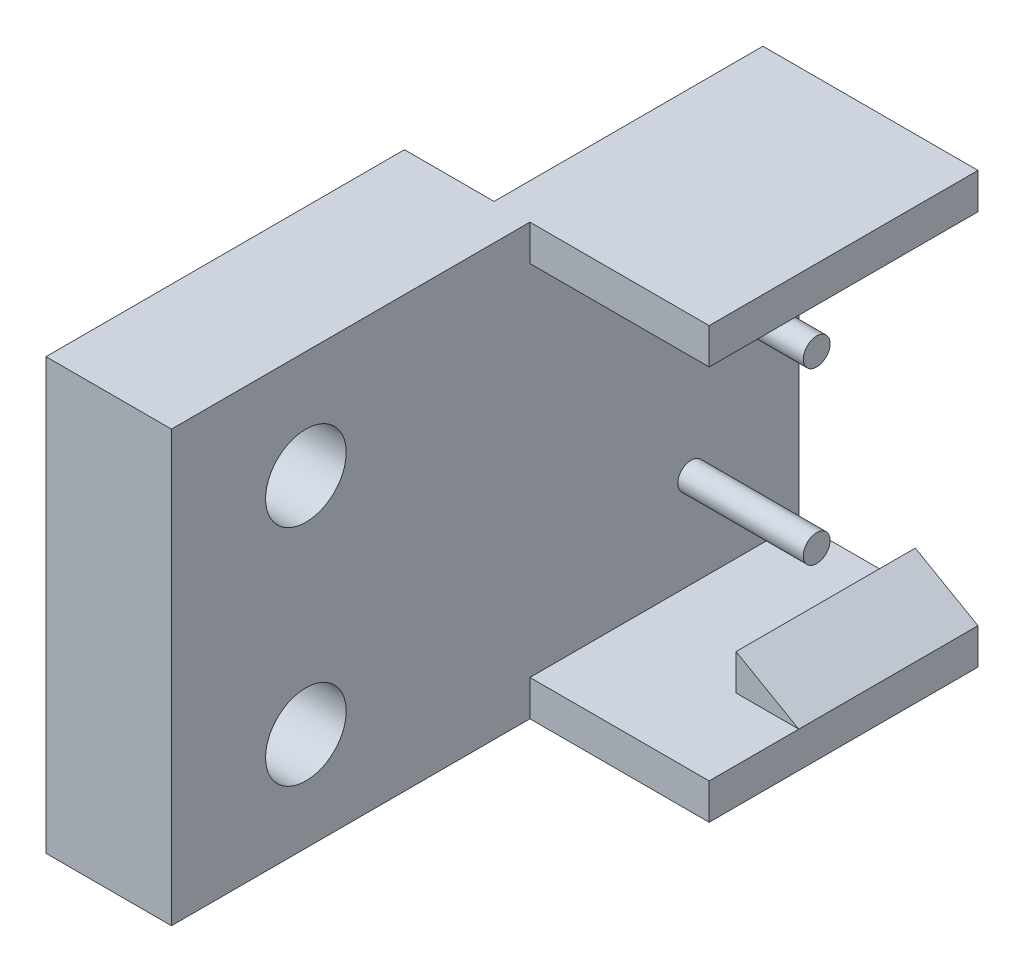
ISO-10303-21;
HEADER;
FILE_DESCRIPTION(('STEP AP214'),'2;1');
FILE_NAME('part.step','',(''),(''),'','','');
FILE_SCHEMA(('AUTOMOTIVE_DESIGN { 1 0 10303 214 1 1 1 1 }'));
ENDSEC;
DATA;
#1=APPLICATION_CONTEXT('core data for automotive mechanical design processes');
#2=APPLICATION_PROTOCOL_DEFINITION('international standard','automotive_design',2000,#1);
#3=PRODUCT_CONTEXT('',#1,'mechanical');
#4=PRODUCT('Part','Part','',(#3));
#5=PRODUCT_RELATED_PRODUCT_CATEGORY('part','',(#4));
#6=PRODUCT_DEFINITION_FORMATION('','',#4);
#7=PRODUCT_DEFINITION_CONTEXT('part definition',#1,'design');
#8=PRODUCT_DEFINITION('design','',#6,#7);
#9=PRODUCT_DEFINITION_SHAPE('','',#8);
#10=(LENGTH_UNIT() NAMED_UNIT(*) SI_UNIT(.MILLI.,.METRE.));
#11=(NAMED_UNIT(*) PLANE_ANGLE_UNIT() SI_UNIT($,.RADIAN.));
#12=(NAMED_UNIT(*) SI_UNIT($,.STERADIAN.) SOLID_ANGLE_UNIT());
#13=UNCERTAINTY_MEASURE_WITH_UNIT(LENGTH_MEASURE(1.E-05),#10,'distance_accuracy_value','');
#14=(GEOMETRIC_REPRESENTATION_CONTEXT(3) GLOBAL_UNCERTAINTY_ASSIGNED_CONTEXT((#13)) GLOBAL_UNIT_ASSIGNED_CONTEXT((#10,
#11,#12)) REPRESENTATION_CONTEXT('',''));
#15=CARTESIAN_POINT('',(0.,0.,0.));
#16=DIRECTION('',(0.,0.,1.));
#17=DIRECTION('',(1.,0.,0.));
#18=AXIS2_PLACEMENT_3D('',#15,#16,#17);
#19=CARTESIAN_POINT('',(2.,0.,0.));
#20=DIRECTION('',(0.,0.,-1.));
#21=DIRECTION('',(0.,1.,0.));
#22=AXIS2_PLACEMENT_3D('',#19,#20,#21);
#23=PLANE('',#22);
#24=DIRECTION('',(-1.,0.,0.));
#25=VECTOR('',#24,1.);
#26=CARTESIAN_POINT('',(2.,24.,0.));
#27=LINE('',#26,#25);
#28=CARTESIAN_POINT('',(12.,24.,0.));
#29=VERTEX_POINT('',#28);
#30=CARTESIAN_POINT('',(2.,24.,0.));
#31=VERTEX_POINT('',#30);
#32=EDGE_CURVE('E223',#29,#31,#27,.T.);
#33=ORIENTED_EDGE('',*,*,#32,.T.);
#34=DIRECTION('',(0.,-1.,0.));
#35=VECTOR('',#34,1.);
#36=CARTESIAN_POINT('',(2.,24.,0.));
#37=LINE('',#36,#35);
#38=CARTESIAN_POINT('',(2.,22.,0.));
#39=VERTEX_POINT('',#38);
#40=EDGE_CURVE('E175',#31,#39,#37,.T.);
#41=ORIENTED_EDGE('',*,*,#40,.T.);
#42=DIRECTION('',(-1.,0.,0.));
#43=VECTOR('',#42,1.);
#44=CARTESIAN_POINT('',(12.,22.,0.));
#45=LINE('',#44,#43);
#46=CARTESIAN_POINT('',(12.,22.,0.));
#47=VERTEX_POINT('',#46);
#48=EDGE_CURVE('E212',#47,#39,#45,.T.);
#49=ORIENTED_EDGE('',*,*,#48,.F.);
#50=DIRECTION('',(0.,-1.,0.));
#51=VECTOR('',#50,1.);
#52=CARTESIAN_POINT('',(12.,24.,0.));
#53=LINE('',#52,#51);
#54=EDGE_CURVE('E236',#29,#47,#53,.T.);
#55=ORIENTED_EDGE('',*,*,#54,.F.);
#56=EDGE_LOOP('',(#33,#41,#49,#55));
#57=FACE_BOUND('',#56,.T.);
#58=ADVANCED_FACE('F33',(#57),#23,.F.);
#59=CARTESIAN_POINT('',(2.,0.,0.));
#60=DIRECTION('',(-1.,0.,0.));
#61=DIRECTION('',(0.,0.,1.));
#62=AXIS2_PLACEMENT_3D('',#59,#60,#61);
#63=PLANE('',#62);
#64=CARTESIAN_POINT('',(2.,16.75,-9.));
#65=DIRECTION('',(-1.,0.,0.));
#66=DIRECTION('',(0.,0.,1.));
#67=AXIS2_PLACEMENT_3D('',#64,#65,#66);
#68=CIRCLE('',#67,0.75);
#69=CARTESIAN_POINT('',(2.,16.75,-8.25));
#70=VERTEX_POINT('',#69);
#71=EDGE_CURVE('E228',#70,#70,#68,.F.);
#72=ORIENTED_EDGE('',*,*,#71,.F.);
#73=EDGE_LOOP('',(#72));
#74=FACE_BOUND('',#73,.T.);
#75=DIRECTION('',(0.,0.,1.));
#76=VECTOR('',#75,1.);
#77=CARTESIAN_POINT('',(2.,2.,0.));
#78=LINE('',#77,#76);
#79=CARTESIAN_POINT('',(2.,2.,-15.));
#80=VERTEX_POINT('',#79);
#81=CARTESIAN_POINT('',(2.,2.,0.));
#82=VERTEX_POINT('',#81);
#83=EDGE_CURVE('E184',#80,#82,#78,.T.);
#84=ORIENTED_EDGE('',*,*,#83,.F.);
#85=DIRECTION('',(0.,1.,0.));
#86=VECTOR('',#85,1.);
#87=CARTESIAN_POINT('',(2.,0.,-15.));
#88=LINE('',#87,#86);
#89=CARTESIAN_POINT('',(2.,22.,-15.));
#90=VERTEX_POINT('',#89);
#91=EDGE_CURVE('E205',#80,#90,#88,.T.);
#92=ORIENTED_EDGE('',*,*,#91,.T.);
#93=DIRECTION('',(0.,0.,-1.));
#94=VECTOR('',#93,1.);
#95=CARTESIAN_POINT('',(2.,22.,0.));
#96=LINE('',#95,#94);
#97=EDGE_CURVE('E233',#39,#90,#96,.T.);
#98=ORIENTED_EDGE('',*,*,#97,.F.);
#99=ORIENTED_EDGE('',*,*,#40,.F.);
#100=DIRECTION('',(0.,0.,-1.));
#101=VECTOR('',#100,1.);
#102=CARTESIAN_POINT('',(2.,24.,0.));
#103=LINE('',#102,#101);
#104=CARTESIAN_POINT('',(2.,24.,20.));
#105=VERTEX_POINT('',#104);
#106=EDGE_CURVE('E169',#105,#31,#103,.T.);
#107=ORIENTED_EDGE('',*,*,#106,.F.);
#108=DIRECTION('',(0.,1.,0.));
#109=VECTOR('',#108,1.);
#110=CARTESIAN_POINT('',(2.,24.,20.));
#111=LINE('',#110,#109);
#112=CARTESIAN_POINT('',(2.,0.,20.));
#113=VERTEX_POINT('',#112);
#114=EDGE_CURVE('E158',#113,#105,#111,.T.);
#115=ORIENTED_EDGE('',*,*,#114,.F.);
#116=DIRECTION('',(0.,0.,1.));
#117=VECTOR('',#116,1.);
#118=CARTESIAN_POINT('',(2.,0.,0.));
#119=LINE('',#118,#117);
#120=CARTESIAN_POINT('',(2.,0.,0.));
#121=VERTEX_POINT('',#120);
#122=EDGE_CURVE('E50',#121,#113,#119,.T.);
#123=ORIENTED_EDGE('',*,*,#122,.F.);
#124=EDGE_CURVE('E11',#82,#121,#37,.T.);
#125=ORIENTED_EDGE('',*,*,#124,.F.);
#126=EDGE_LOOP('',(#84,#92,#98,#99,#107,#115,#123,#125));
#127=FACE_BOUND('',#126,.T.);
#128=CARTESIAN_POINT('',(2.,7.25,-9.));
#129=DIRECTION('',(-1.,0.,0.));
#130=DIRECTION('',(0.,0.,1.));
#131=AXIS2_PLACEMENT_3D('',#128,#129,#130);
#132=CIRCLE('',#131,0.75);
#133=CARTESIAN_POINT('',(2.,7.25,-8.25));
#134=VERTEX_POINT('',#133);
#135=EDGE_CURVE('E42',#134,#134,#132,.F.);
#136=ORIENTED_EDGE('',*,*,#135,.F.);
#137=EDGE_LOOP('',(#136));
#138=FACE_BOUND('',#137,.T.);
#139=CARTESIAN_POINT('',(2.,5.5,12.5));
#140=DIRECTION('',(-1.,0.,0.));
#141=DIRECTION('',(0.,0.,1.));
#142=AXIS2_PLACEMENT_3D('',#139,#140,#141);
#143=CIRCLE('',#142,2.25);
#144=CARTESIAN_POINT('',(2.,5.5,14.75));
#145=VERTEX_POINT('',#144);
#146=EDGE_CURVE('E342',#145,#145,#143,.T.);
#147=ORIENTED_EDGE('',*,*,#146,.T.);
#148=EDGE_LOOP('',(#147));
#149=FACE_BOUND('',#148,.T.);
#150=CARTESIAN_POINT('',(2.,18.,12.5));
#151=DIRECTION('',(-1.,0.,0.));
#152=DIRECTION('',(0.,0.,1.));
#153=AXIS2_PLACEMENT_3D('',#150,#151,#152);
#154=CIRCLE('',#153,2.25);
#155=CARTESIAN_POINT('',(2.,18.,14.75));
#156=VERTEX_POINT('',#155);
#157=EDGE_CURVE('E177',#156,#156,#154,.T.);
#158=ORIENTED_EDGE('',*,*,#157,.T.);
#159=EDGE_LOOP('',(#158));
#160=FACE_BOUND('',#159,.T.);
#161=ADVANCED_FACE('F166',(#74,#127,#138,#149,#160),#63,.F.);
#162=DIRECTION('',(-1.,0.,0.));
#163=VECTOR('',#162,1.);
#164=CARTESIAN_POINT('',(12.,2.,0.));
#165=LINE('',#164,#163);
#166=CARTESIAN_POINT('',(12.,2.,0.));
#167=VERTEX_POINT('',#166);
#168=EDGE_CURVE('E191',#167,#82,#165,.T.);
#169=ORIENTED_EDGE('',*,*,#168,.T.);
#170=ORIENTED_EDGE('',*,*,#124,.T.);
#171=DIRECTION('',(-1.,0.,0.));
#172=VECTOR('',#171,1.);
#173=CARTESIAN_POINT('',(2.,0.,0.));
#174=LINE('',#173,#172);
#175=CARTESIAN_POINT('',(12.,0.,0.));
#176=VERTEX_POINT('',#175);
#177=EDGE_CURVE('E174',#176,#121,#174,.T.);
#178=ORIENTED_EDGE('',*,*,#177,.F.);
#179=DIRECTION('',(0.,-1.,0.));
#180=VECTOR('',#179,1.);
#181=CARTESIAN_POINT('',(12.,0.,0.));
#182=LINE('',#181,#180);
#183=EDGE_CURVE('E187',#167,#176,#182,.T.);
#184=ORIENTED_EDGE('',*,*,#183,.F.);
#185=EDGE_LOOP('',(#169,#170,#178,#184));
#186=FACE_BOUND('',#185,.T.);
#187=ADVANCED_FACE('F35',(#186),#23,.F.);
#188=CARTESIAN_POINT('',(2.,0.,0.));
#189=DIRECTION('',(0.,1.,0.));
#190=DIRECTION('',(0.,0.,1.));
#191=AXIS2_PLACEMENT_3D('',#188,#189,#190);
#192=PLANE('',#191);
#193=DIRECTION('',(0.,0.,-1.));
#194=VECTOR('',#193,1.);
#195=CARTESIAN_POINT('',(0.,0.,0.));
#196=LINE('',#195,#194);
#197=CARTESIAN_POINT('',(0.,0.,0.));
#198=VERTEX_POINT('',#197);
#199=CARTESIAN_POINT('',(0.,0.,-15.));
#200=VERTEX_POINT('',#199);
#201=EDGE_CURVE('E211',#198,#200,#196,.T.);
#202=ORIENTED_EDGE('',*,*,#201,.T.);
#203=DIRECTION('',(-1.,0.,0.));
#204=VECTOR('',#203,1.);
#205=CARTESIAN_POINT('',(2.,0.,-15.));
#206=LINE('',#205,#204);
#207=CARTESIAN_POINT('',(12.,0.,-15.));
#208=VERTEX_POINT('',#207);
#209=EDGE_CURVE('E229',#208,#200,#206,.T.);
#210=ORIENTED_EDGE('',*,*,#209,.F.);
#211=DIRECTION('',(0.,0.,-1.));
#212=VECTOR('',#211,1.);
#213=CARTESIAN_POINT('',(12.,0.,0.));
#214=LINE('',#213,#212);
#215=EDGE_CURVE('E260',#176,#208,#214,.T.);
#216=ORIENTED_EDGE('',*,*,#215,.F.);
#217=ORIENTED_EDGE('',*,*,#177,.T.);
#218=ORIENTED_EDGE('',*,*,#122,.T.);
#219=DIRECTION('',(1.,0.,0.));
#220=VECTOR('',#219,1.);
#221=CARTESIAN_POINT('',(-5.,0.,20.));
#222=LINE('',#221,#220);
#223=CARTESIAN_POINT('',(-5.,0.,20.));
#224=VERTEX_POINT('',#223);
#225=EDGE_CURVE('E155',#224,#113,#222,.T.);
#226=ORIENTED_EDGE('',*,*,#225,.F.);
#227=DIRECTION('',(0.,0.,1.));
#228=VECTOR('',#227,1.);
#229=CARTESIAN_POINT('',(-5.,0.,0.));
#230=LINE('',#229,#228);
#231=CARTESIAN_POINT('',(-5.,0.,0.));
#232=VERTEX_POINT('',#231);
#233=EDGE_CURVE('E328',#232,#224,#230,.T.);
#234=ORIENTED_EDGE('',*,*,#233,.F.);
#235=DIRECTION('',(1.,0.,0.));
#236=VECTOR('',#235,1.);
#237=CARTESIAN_POINT('',(-5.,0.,0.));
#238=LINE('',#237,#236);
#239=EDGE_CURVE('E162',#232,#198,#238,.T.);
#240=ORIENTED_EDGE('',*,*,#239,.T.);
#241=EDGE_LOOP('',(#202,#210,#216,#217,#218,#226,#234,#240));
#242=FACE_BOUND('',#241,.T.);
#243=ADVANCED_FACE('F172',(#242),#192,.F.);
#244=CARTESIAN_POINT('',(2.,0.,-15.));
#245=DIRECTION('',(0.,0.,1.));
#246=DIRECTION('',(0.,-1.,0.));
#247=AXIS2_PLACEMENT_3D('',#244,#245,#246);
#248=PLANE('',#247);
#249=DIRECTION('',(0.,1.,0.));
#250=VECTOR('',#249,1.);
#251=CARTESIAN_POINT('',(0.,0.,-15.));
#252=LINE('',#251,#250);
#253=CARTESIAN_POINT('',(0.,24.,-15.));
#254=VERTEX_POINT('',#253);
#255=EDGE_CURVE('E206',#200,#254,#252,.T.);
#256=ORIENTED_EDGE('',*,*,#255,.T.);
#257=DIRECTION('',(-1.,0.,0.));
#258=VECTOR('',#257,1.);
#259=CARTESIAN_POINT('',(2.,24.,-15.));
#260=LINE('',#259,#258);
#261=CARTESIAN_POINT('',(12.,24.,-15.));
#262=VERTEX_POINT('',#261);
#263=EDGE_CURVE('E221',#262,#254,#260,.T.);
#264=ORIENTED_EDGE('',*,*,#263,.F.);
#265=DIRECTION('',(0.,1.,0.));
#266=VECTOR('',#265,1.);
#267=CARTESIAN_POINT('',(12.,24.,-15.));
#268=LINE('',#267,#266);
#269=CARTESIAN_POINT('',(12.,22.,-15.));
#270=VERTEX_POINT('',#269);
#271=EDGE_CURVE('E245',#270,#262,#268,.T.);
#272=ORIENTED_EDGE('',*,*,#271,.F.);
#273=DIRECTION('',(-0.868243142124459,-0.496138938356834,0.));
#274=VECTOR('',#273,1.);
#275=CARTESIAN_POINT('',(12.,22.,-15.));
#276=LINE('',#275,#274);
#277=CARTESIAN_POINT('',(8.5,20.,-15.));
#278=VERTEX_POINT('',#277);
#279=EDGE_CURVE('E276',#270,#278,#276,.T.);
#280=ORIENTED_EDGE('',*,*,#279,.T.);
#281=DIRECTION('',(0.,1.,0.));
#282=VECTOR('',#281,1.);
#283=CARTESIAN_POINT('',(8.5,20.,-15.));
#284=LINE('',#283,#282);
#285=CARTESIAN_POINT('',(8.5,22.,-15.));
#286=VERTEX_POINT('',#285);
#287=EDGE_CURVE('E272',#278,#286,#284,.T.);
#288=ORIENTED_EDGE('',*,*,#287,.T.);
#289=DIRECTION('',(-1.,0.,0.));
#290=VECTOR('',#289,1.);
#291=CARTESIAN_POINT('',(12.,22.,-15.));
#292=LINE('',#291,#290);
#293=EDGE_CURVE('E244',#286,#90,#292,.T.);
#294=ORIENTED_EDGE('',*,*,#293,.T.);
#295=ORIENTED_EDGE('',*,*,#91,.F.);
#296=DIRECTION('',(-1.,0.,0.));
#297=VECTOR('',#296,1.);
#298=CARTESIAN_POINT('',(12.,2.,-15.));
#299=LINE('',#298,#297);
#300=CARTESIAN_POINT('',(8.5,2.,-15.));
#301=VERTEX_POINT('',#300);
#302=EDGE_CURVE('E194',#301,#80,#299,.T.);
#303=ORIENTED_EDGE('',*,*,#302,.F.);
#304=DIRECTION('',(0.,1.,0.));
#305=VECTOR('',#304,1.);
#306=CARTESIAN_POINT('',(8.5,4.,-15.));
#307=LINE('',#306,#305);
#308=CARTESIAN_POINT('',(8.5,4.,-15.));
#309=VERTEX_POINT('',#308);
#310=EDGE_CURVE('E295',#301,#309,#307,.T.);
#311=ORIENTED_EDGE('',*,*,#310,.T.);
#312=DIRECTION('',(0.868243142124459,-0.496138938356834,0.));
#313=VECTOR('',#312,1.);
#314=CARTESIAN_POINT('',(12.,2.,-15.));
#315=LINE('',#314,#313);
#316=CARTESIAN_POINT('',(12.,2.,-15.));
#317=VERTEX_POINT('',#316);
#318=EDGE_CURVE('E291',#309,#317,#315,.T.);
#319=ORIENTED_EDGE('',*,*,#318,.T.);
#320=DIRECTION('',(0.,1.,0.));
#321=VECTOR('',#320,1.);
#322=CARTESIAN_POINT('',(12.,0.,-15.));
#323=LINE('',#322,#321);
#324=EDGE_CURVE('E257',#208,#317,#323,.T.);
#325=ORIENTED_EDGE('',*,*,#324,.F.);
#326=ORIENTED_EDGE('',*,*,#209,.T.);
#327=EDGE_LOOP('',(#256,#264,#272,#280,#288,#294,#295,#303,#311,#319,#325,#326));
#328=FACE_BOUND('',#327,.T.);
#329=ADVANCED_FACE('F370',(#328),#248,.F.);
#330=CARTESIAN_POINT('',(2.,24.,0.));
#331=DIRECTION('',(0.,-1.,0.));
#332=DIRECTION('',(0.,0.,-1.));
#333=AXIS2_PLACEMENT_3D('',#330,#331,#332);
#334=PLANE('',#333);
#335=DIRECTION('',(0.,0.,1.));
#336=VECTOR('',#335,1.);
#337=CARTESIAN_POINT('',(0.,24.,0.));
#338=LINE('',#337,#336);
#339=CARTESIAN_POINT('',(0.,24.,0.));
#340=VERTEX_POINT('',#339);
#341=EDGE_CURVE('E202',#254,#340,#338,.T.);
#342=ORIENTED_EDGE('',*,*,#341,.T.);
#343=DIRECTION('',(1.,0.,0.));
#344=VECTOR('',#343,1.);
#345=CARTESIAN_POINT('',(-5.,24.,0.));
#346=LINE('',#345,#344);
#347=CARTESIAN_POINT('',(-5.,24.,0.));
#348=VERTEX_POINT('',#347);
#349=EDGE_CURVE('E315',#348,#340,#346,.T.);
#350=ORIENTED_EDGE('',*,*,#349,.F.);
#351=DIRECTION('',(0.,0.,-1.));
#352=VECTOR('',#351,1.);
#353=CARTESIAN_POINT('',(-5.,24.,0.));
#354=LINE('',#353,#352);
#355=CARTESIAN_POINT('',(-5.,24.,20.));
#356=VERTEX_POINT('',#355);
#357=EDGE_CURVE('E317',#356,#348,#354,.T.);
#358=ORIENTED_EDGE('',*,*,#357,.F.);
#359=DIRECTION('',(1.,0.,0.));
#360=VECTOR('',#359,1.);
#361=CARTESIAN_POINT('',(-5.,24.,20.));
#362=LINE('',#361,#360);
#363=EDGE_CURVE('E163',#356,#105,#362,.T.);
#364=ORIENTED_EDGE('',*,*,#363,.T.);
#365=ORIENTED_EDGE('',*,*,#106,.T.);
#366=ORIENTED_EDGE('',*,*,#32,.F.);
#367=DIRECTION('',(0.,0.,1.));
#368=VECTOR('',#367,1.);
#369=CARTESIAN_POINT('',(12.,24.,0.));
#370=LINE('',#369,#368);
#371=EDGE_CURVE('E241',#262,#29,#370,.T.);
#372=ORIENTED_EDGE('',*,*,#371,.F.);
#373=ORIENTED_EDGE('',*,*,#263,.T.);
#374=EDGE_LOOP('',(#342,#350,#358,#364,#365,#366,#372,#373));
#375=FACE_BOUND('',#374,.T.);
#376=ADVANCED_FACE('F323',(#375),#334,.F.);
#377=CARTESIAN_POINT('',(0.,0.,0.));
#378=DIRECTION('',(-1.,0.,0.));
#379=DIRECTION('',(0.,0.,1.));
#380=AXIS2_PLACEMENT_3D('',#377,#378,#379);
#381=PLANE('',#380);
#382=DIRECTION('',(0.,-1.,0.));
#383=VECTOR('',#382,1.);
#384=CARTESIAN_POINT('',(0.,0.,0.));
#385=LINE('',#384,#383);
#386=EDGE_CURVE('E209',#340,#198,#385,.T.);
#387=ORIENTED_EDGE('',*,*,#386,.F.);
#388=ORIENTED_EDGE('',*,*,#341,.F.);
#389=ORIENTED_EDGE('',*,*,#255,.F.);
#390=ORIENTED_EDGE('',*,*,#201,.F.);
#391=EDGE_LOOP('',(#387,#388,#389,#390));
#392=FACE_BOUND('',#391,.T.);
#393=ADVANCED_FACE('F454',(#392),#381,.T.);
#394=CARTESIAN_POINT('',(12.,22.,0.));
#395=DIRECTION('',(0.,1.,0.));
#396=DIRECTION('',(0.,0.,1.));
#397=AXIS2_PLACEMENT_3D('',#394,#395,#396);
#398=PLANE('',#397);
#399=ORIENTED_EDGE('',*,*,#293,.F.);
#400=DIRECTION('',(0.,0.,-1.));
#401=VECTOR('',#400,1.);
#402=CARTESIAN_POINT('',(8.5,22.,-5.));
#403=LINE('',#402,#401);
#404=CARTESIAN_POINT('',(8.5,22.,-5.));
#405=VERTEX_POINT('',#404);
#406=EDGE_CURVE('E188',#405,#286,#403,.T.);
#407=ORIENTED_EDGE('',*,*,#406,.F.);
#408=DIRECTION('',(1.,0.,0.));
#409=VECTOR('',#408,1.);
#410=CARTESIAN_POINT('',(12.,22.,-5.));
#411=LINE('',#410,#409);
#412=CARTESIAN_POINT('',(12.,22.,-5.));
#413=VERTEX_POINT('',#412);
#414=EDGE_CURVE('E275',#405,#413,#411,.T.);
#415=ORIENTED_EDGE('',*,*,#414,.T.);
#416=DIRECTION('',(0.,0.,-1.));
#417=VECTOR('',#416,1.);
#418=CARTESIAN_POINT('',(12.,22.,0.));
#419=LINE('',#418,#417);
#420=EDGE_CURVE('E248',#47,#413,#419,.T.);
#421=ORIENTED_EDGE('',*,*,#420,.F.);
#422=ORIENTED_EDGE('',*,*,#48,.T.);
#423=ORIENTED_EDGE('',*,*,#97,.T.);
#424=EDGE_LOOP('',(#399,#407,#415,#421,#422,#423));
#425=FACE_BOUND('',#424,.T.);
#426=ADVANCED_FACE('F385',(#425),#398,.F.);
#427=CARTESIAN_POINT('',(12.,0.,0.));
#428=DIRECTION('',(1.,0.,0.));
#429=DIRECTION('',(0.,0.,-1.));
#430=AXIS2_PLACEMENT_3D('',#427,#428,#429);
#431=PLANE('',#430);
#432=ORIENTED_EDGE('',*,*,#54,.T.);
#433=ORIENTED_EDGE('',*,*,#420,.T.);
#434=DIRECTION('',(0.,0.,-1.));
#435=VECTOR('',#434,1.);
#436=CARTESIAN_POINT('',(12.,22.,-5.));
#437=LINE('',#436,#435);
#438=EDGE_CURVE('E265',#413,#270,#437,.T.);
#439=ORIENTED_EDGE('',*,*,#438,.T.);
#440=ORIENTED_EDGE('',*,*,#271,.T.);
#441=ORIENTED_EDGE('',*,*,#371,.T.);
#442=EDGE_LOOP('',(#432,#433,#439,#440,#441));
#443=FACE_BOUND('',#442,.T.);
#444=ADVANCED_FACE('F449',(#443),#431,.T.);
#445=CARTESIAN_POINT('',(12.,2.,0.));
#446=DIRECTION('',(0.,-1.,0.));
#447=DIRECTION('',(0.,0.,-1.));
#448=AXIS2_PLACEMENT_3D('',#445,#446,#447);
#449=PLANE('',#448);
#450=DIRECTION('',(-1.,0.,0.));
#451=VECTOR('',#450,1.);
#452=CARTESIAN_POINT('',(12.,2.,-5.));
#453=LINE('',#452,#451);
#454=CARTESIAN_POINT('',(12.,2.,-5.));
#455=VERTEX_POINT('',#454);
#456=CARTESIAN_POINT('',(8.5,2.,-5.));
#457=VERTEX_POINT('',#456);
#458=EDGE_CURVE('E294',#455,#457,#453,.T.);
#459=ORIENTED_EDGE('',*,*,#458,.T.);
#460=DIRECTION('',(0.,0.,-1.));
#461=VECTOR('',#460,1.);
#462=CARTESIAN_POINT('',(8.5,2.,-5.));
#463=LINE('',#462,#461);
#464=EDGE_CURVE('E287',#457,#301,#463,.T.);
#465=ORIENTED_EDGE('',*,*,#464,.T.);
#466=ORIENTED_EDGE('',*,*,#302,.T.);
#467=ORIENTED_EDGE('',*,*,#83,.T.);
#468=ORIENTED_EDGE('',*,*,#168,.F.);
#469=DIRECTION('',(0.,0.,1.));
#470=VECTOR('',#469,1.);
#471=CARTESIAN_POINT('',(12.,2.,0.));
#472=LINE('',#471,#470);
#473=EDGE_CURVE('E256',#455,#167,#472,.T.);
#474=ORIENTED_EDGE('',*,*,#473,.F.);
#475=EDGE_LOOP('',(#459,#465,#466,#467,#468,#474));
#476=FACE_BOUND('',#475,.T.);
#477=ADVANCED_FACE('F375',(#476),#449,.F.);
#478=CARTESIAN_POINT('',(12.,0.,0.));
#479=DIRECTION('',(-1.,0.,0.));
#480=DIRECTION('',(0.,0.,1.));
#481=AXIS2_PLACEMENT_3D('',#478,#479,#480);
#482=PLANE('',#481);
#483=ORIENTED_EDGE('',*,*,#183,.T.);
#484=ORIENTED_EDGE('',*,*,#215,.T.);
#485=ORIENTED_EDGE('',*,*,#324,.T.);
#486=EDGE_CURVE('E195',#317,#455,#472,.T.);
#487=ORIENTED_EDGE('',*,*,#486,.T.);
#488=ORIENTED_EDGE('',*,*,#473,.T.);
#489=EDGE_LOOP('',(#483,#484,#485,#487,#488));
#490=FACE_BOUND('',#489,.T.);
#491=ADVANCED_FACE('F439',(#490),#482,.F.);
#492=CARTESIAN_POINT('',(8.5,20.,-5.));
#493=DIRECTION('',(-1.,0.,0.));
#494=DIRECTION('',(0.,0.,1.));
#495=AXIS2_PLACEMENT_3D('',#492,#493,#494);
#496=PLANE('',#495);
#497=ORIENTED_EDGE('',*,*,#287,.F.);
#498=DIRECTION('',(0.,0.,-1.));
#499=VECTOR('',#498,1.);
#500=CARTESIAN_POINT('',(8.5,20.,-5.));
#501=LINE('',#500,#499);
#502=CARTESIAN_POINT('',(8.5,20.,-5.));
#503=VERTEX_POINT('',#502);
#504=EDGE_CURVE('E268',#503,#278,#501,.T.);
#505=ORIENTED_EDGE('',*,*,#504,.F.);
#506=DIRECTION('',(0.,1.,0.));
#507=VECTOR('',#506,1.);
#508=CARTESIAN_POINT('',(8.5,20.,-5.));
#509=LINE('',#508,#507);
#510=EDGE_CURVE('E269',#503,#405,#509,.T.);
#511=ORIENTED_EDGE('',*,*,#510,.T.);
#512=ORIENTED_EDGE('',*,*,#406,.T.);
#513=EDGE_LOOP('',(#497,#505,#511,#512));
#514=FACE_BOUND('',#513,.T.);
#515=ADVANCED_FACE('F436',(#514),#496,.T.);
#516=CARTESIAN_POINT('',(12.,22.,-5.));
#517=DIRECTION('',(0.496138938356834,-0.868243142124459,0.));
#518=DIRECTION('',(0.868243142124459,0.496138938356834,0.));
#519=AXIS2_PLACEMENT_3D('',#516,#517,#518);
#520=PLANE('',#519);
#521=ORIENTED_EDGE('',*,*,#279,.F.);
#522=ORIENTED_EDGE('',*,*,#438,.F.);
#523=DIRECTION('',(-0.868243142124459,-0.496138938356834,0.));
#524=VECTOR('',#523,1.);
#525=CARTESIAN_POINT('',(12.,22.,-5.));
#526=LINE('',#525,#524);
#527=EDGE_CURVE('E282',#413,#503,#526,.T.);
#528=ORIENTED_EDGE('',*,*,#527,.T.);
#529=ORIENTED_EDGE('',*,*,#504,.T.);
#530=EDGE_LOOP('',(#521,#522,#528,#529));
#531=FACE_BOUND('',#530,.T.);
#532=ADVANCED_FACE('F434',(#531),#520,.T.);
#533=CARTESIAN_POINT('',(0.,0.,-5.00000000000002));
#534=DIRECTION('',(0.,0.,-1.));
#535=DIRECTION('',(0.,1.,0.));
#536=AXIS2_PLACEMENT_3D('',#533,#534,#535);
#537=PLANE('',#536);
#538=ORIENTED_EDGE('',*,*,#414,.F.);
#539=ORIENTED_EDGE('',*,*,#510,.F.);
#540=ORIENTED_EDGE('',*,*,#527,.F.);
#541=EDGE_LOOP('',(#538,#539,#540));
#542=FACE_BOUND('',#541,.T.);
#543=ADVANCED_FACE('F428',(#542),#537,.F.);
#544=CARTESIAN_POINT('',(12.,2.,-5.));
#545=DIRECTION('',(0.496138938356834,0.868243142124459,0.));
#546=DIRECTION('',(-0.868243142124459,0.496138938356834,0.));
#547=AXIS2_PLACEMENT_3D('',#544,#545,#546);
#548=PLANE('',#547);
#549=ORIENTED_EDGE('',*,*,#318,.F.);
#550=DIRECTION('',(0.,0.,-1.));
#551=VECTOR('',#550,1.);
#552=CARTESIAN_POINT('',(8.5,4.,-5.));
#553=LINE('',#552,#551);
#554=CARTESIAN_POINT('',(8.5,4.,-5.));
#555=VERTEX_POINT('',#554);
#556=EDGE_CURVE('E279',#555,#309,#553,.T.);
#557=ORIENTED_EDGE('',*,*,#556,.F.);
#558=DIRECTION('',(0.868243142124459,-0.496138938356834,0.));
#559=VECTOR('',#558,1.);
#560=CARTESIAN_POINT('',(12.,2.,-5.));
#561=LINE('',#560,#559);
#562=EDGE_CURVE('E57',#555,#455,#561,.T.);
#563=ORIENTED_EDGE('',*,*,#562,.T.);
#564=ORIENTED_EDGE('',*,*,#486,.F.);
#565=EDGE_LOOP('',(#549,#557,#563,#564));
#566=FACE_BOUND('',#565,.T.);
#567=ADVANCED_FACE('F425',(#566),#548,.T.);
#568=CARTESIAN_POINT('',(8.5,4.,-5.));
#569=DIRECTION('',(-1.,0.,0.));
#570=DIRECTION('',(0.,0.,1.));
#571=AXIS2_PLACEMENT_3D('',#568,#569,#570);
#572=PLANE('',#571);
#573=ORIENTED_EDGE('',*,*,#310,.F.);
#574=ORIENTED_EDGE('',*,*,#464,.F.);
#575=DIRECTION('',(0.,1.,0.));
#576=VECTOR('',#575,1.);
#577=CARTESIAN_POINT('',(8.5,4.,-5.));
#578=LINE('',#577,#576);
#579=EDGE_CURVE('E300',#457,#555,#578,.T.);
#580=ORIENTED_EDGE('',*,*,#579,.T.);
#581=ORIENTED_EDGE('',*,*,#556,.T.);
#582=EDGE_LOOP('',(#573,#574,#580,#581));
#583=FACE_BOUND('',#582,.T.);
#584=ADVANCED_FACE('F423',(#583),#572,.T.);
#585=CARTESIAN_POINT('',(0.,0.,-5.));
#586=DIRECTION('',(0.,0.,1.));
#587=DIRECTION('',(0.,-1.,0.));
#588=AXIS2_PLACEMENT_3D('',#585,#586,#587);
#589=PLANE('',#588);
#590=ORIENTED_EDGE('',*,*,#458,.F.);
#591=ORIENTED_EDGE('',*,*,#562,.F.);
#592=ORIENTED_EDGE('',*,*,#579,.F.);
#593=EDGE_LOOP('',(#590,#591,#592));
#594=FACE_BOUND('',#593,.T.);
#595=ADVANCED_FACE('F419',(#594),#589,.T.);
#596=CARTESIAN_POINT('',(9.,16.75,-9.));
#597=DIRECTION('',(-1.,0.,0.));
#598=DIRECTION('',(0.,0.,1.));
#599=AXIS2_PLACEMENT_3D('',#596,#597,#598);
#600=CYLINDRICAL_SURFACE('',#599,0.75);
#601=CARTESIAN_POINT('',(9.,16.75,-9.));
#602=DIRECTION('',(1.,0.,0.));
#603=DIRECTION('',(0.,0.,-1.));
#604=AXIS2_PLACEMENT_3D('',#601,#602,#603);
#605=CIRCLE('',#604,0.75);
#606=CARTESIAN_POINT('',(9.,16.75,-9.75));
#607=VERTEX_POINT('',#606);
#608=EDGE_CURVE('E298',#607,#607,#605,.T.);
#609=ORIENTED_EDGE('',*,*,#608,.F.);
#610=EDGE_LOOP('',(#609));
#611=FACE_BOUND('',#610,.T.);
#612=ORIENTED_EDGE('',*,*,#71,.T.);
#613=EDGE_LOOP('',(#612));
#614=FACE_BOUND('',#613,.T.);
#615=ADVANCED_FACE('F411',(#611,#614),#600,.T.);
#616=CARTESIAN_POINT('',(9.,16.75,-9.));
#617=DIRECTION('',(1.,0.,0.));
#618=DIRECTION('',(0.,0.,-1.));
#619=AXIS2_PLACEMENT_3D('',#616,#617,#618);
#620=PLANE('',#619);
#621=ORIENTED_EDGE('',*,*,#608,.T.);
#622=EDGE_LOOP('',(#621));
#623=FACE_BOUND('',#622,.T.);
#624=ADVANCED_FACE('F401',(#623),#620,.T.);
#625=CARTESIAN_POINT('',(9.,7.25,-9.));
#626=DIRECTION('',(-1.,0.,0.));
#627=DIRECTION('',(0.,0.,1.));
#628=AXIS2_PLACEMENT_3D('',#625,#626,#627);
#629=CYLINDRICAL_SURFACE('',#628,0.75);
#630=CARTESIAN_POINT('',(9.,7.25,-9.));
#631=DIRECTION('',(1.,0.,0.));
#632=DIRECTION('',(0.,0.,-1.));
#633=AXIS2_PLACEMENT_3D('',#630,#631,#632);
#634=CIRCLE('',#633,0.75);
#635=CARTESIAN_POINT('',(9.,7.25,-9.75));
#636=VERTEX_POINT('',#635);
#637=EDGE_CURVE('E307',#636,#636,#634,.T.);
#638=ORIENTED_EDGE('',*,*,#637,.F.);
#639=EDGE_LOOP('',(#638));
#640=FACE_BOUND('',#639,.T.);
#641=ORIENTED_EDGE('',*,*,#135,.T.);
#642=EDGE_LOOP('',(#641));
#643=FACE_BOUND('',#642,.T.);
#644=ADVANCED_FACE('F398',(#640,#643),#629,.T.);
#645=CARTESIAN_POINT('',(9.,7.25,-9.));
#646=DIRECTION('',(1.,0.,0.));
#647=DIRECTION('',(0.,0.,-1.));
#648=AXIS2_PLACEMENT_3D('',#645,#646,#647);
#649=PLANE('',#648);
#650=ORIENTED_EDGE('',*,*,#637,.T.);
#651=EDGE_LOOP('',(#650));
#652=FACE_BOUND('',#651,.T.);
#653=ADVANCED_FACE('F400',(#652),#649,.T.);
#654=CARTESIAN_POINT('',(-5.,24.,0.));
#655=DIRECTION('',(0.,0.,1.));
#656=DIRECTION('',(1.,0.,0.));
#657=AXIS2_PLACEMENT_3D('',#654,#655,#656);
#658=PLANE('',#657);
#659=ORIENTED_EDGE('',*,*,#349,.T.);
#660=ORIENTED_EDGE('',*,*,#386,.T.);
#661=ORIENTED_EDGE('',*,*,#239,.F.);
#662=DIRECTION('',(0.,-1.,0.));
#663=VECTOR('',#662,1.);
#664=CARTESIAN_POINT('',(-5.,24.,0.));
#665=LINE('',#664,#663);
#666=EDGE_CURVE('E329',#348,#232,#665,.T.);
#667=ORIENTED_EDGE('',*,*,#666,.F.);
#668=EDGE_LOOP('',(#659,#660,#661,#667));
#669=FACE_BOUND('',#668,.T.);
#670=ADVANCED_FACE('F408',(#669),#658,.F.);
#671=CARTESIAN_POINT('',(-5.,0.,0.));
#672=DIRECTION('',(-1.,0.,0.));
#673=DIRECTION('',(0.,0.,1.));
#674=AXIS2_PLACEMENT_3D('',#671,#672,#673);
#675=PLANE('',#674);
#676=CARTESIAN_POINT('',(-5.,18.,12.5));
#677=DIRECTION('',(-1.,0.,0.));
#678=DIRECTION('',(0.,0.,1.));
#679=AXIS2_PLACEMENT_3D('',#676,#677,#678);
#680=CIRCLE('',#679,2.25);
#681=CARTESIAN_POINT('',(-5.,18.,14.75));
#682=VERTEX_POINT('',#681);
#683=EDGE_CURVE('E333',#682,#682,#680,.T.);
#684=ORIENTED_EDGE('',*,*,#683,.F.);
#685=EDGE_LOOP('',(#684));
#686=FACE_BOUND('',#685,.T.);
#687=ORIENTED_EDGE('',*,*,#666,.T.);
#688=ORIENTED_EDGE('',*,*,#233,.T.);
#689=DIRECTION('',(0.,1.,0.));
#690=VECTOR('',#689,1.);
#691=CARTESIAN_POINT('',(-5.,24.,20.));
#692=LINE('',#691,#690);
#693=EDGE_CURVE('E160',#224,#356,#692,.T.);
#694=ORIENTED_EDGE('',*,*,#693,.T.);
#695=ORIENTED_EDGE('',*,*,#357,.T.);
#696=EDGE_LOOP('',(#687,#688,#694,#695));
#697=FACE_BOUND('',#696,.T.);
#698=CARTESIAN_POINT('',(-5.,5.5,12.5));
#699=DIRECTION('',(-1.,0.,0.));
#700=DIRECTION('',(0.,0.,1.));
#701=AXIS2_PLACEMENT_3D('',#698,#699,#700);
#702=CIRCLE('',#701,2.25);
#703=CARTESIAN_POINT('',(-5.,5.5,14.75));
#704=VERTEX_POINT('',#703);
#705=EDGE_CURVE('E199',#704,#704,#702,.T.);
#706=ORIENTED_EDGE('',*,*,#705,.F.);
#707=EDGE_LOOP('',(#706));
#708=FACE_BOUND('',#707,.T.);
#709=ADVANCED_FACE('F475',(#686,#697,#708),#675,.T.);
#710=CARTESIAN_POINT('',(-5.,24.,20.));
#711=DIRECTION('',(0.,0.,-1.));
#712=DIRECTION('',(0.,1.,0.));
#713=AXIS2_PLACEMENT_3D('',#710,#711,#712);
#714=PLANE('',#713);
#715=ORIENTED_EDGE('',*,*,#225,.T.);
#716=ORIENTED_EDGE('',*,*,#114,.T.);
#717=ORIENTED_EDGE('',*,*,#363,.F.);
#718=ORIENTED_EDGE('',*,*,#693,.F.);
#719=EDGE_LOOP('',(#715,#716,#717,#718));
#720=FACE_BOUND('',#719,.T.);
#721=ADVANCED_FACE('F156',(#720),#714,.F.);
#722=CARTESIAN_POINT('',(-5.,18.,12.5));
#723=DIRECTION('',(1.,0.,0.));
#724=DIRECTION('',(0.,0.,-1.));
#725=AXIS2_PLACEMENT_3D('',#722,#723,#724);
#726=CYLINDRICAL_SURFACE('',#725,2.25);
#727=ORIENTED_EDGE('',*,*,#683,.T.);
#728=EDGE_LOOP('',(#727));
#729=FACE_BOUND('',#728,.T.);
#730=ORIENTED_EDGE('',*,*,#157,.F.);
#731=EDGE_LOOP('',(#730));
#732=FACE_BOUND('',#731,.T.);
#733=ADVANCED_FACE('F350',(#729,#732),#726,.F.);
#734=CARTESIAN_POINT('',(-5.,5.5,12.5));
#735=DIRECTION('',(1.,0.,0.));
#736=DIRECTION('',(0.,0.,-1.));
#737=AXIS2_PLACEMENT_3D('',#734,#735,#736);
#738=CYLINDRICAL_SURFACE('',#737,2.25);
#739=ORIENTED_EDGE('',*,*,#705,.T.);
#740=EDGE_LOOP('',(#739));
#741=FACE_BOUND('',#740,.T.);
#742=ORIENTED_EDGE('',*,*,#146,.F.);
#743=EDGE_LOOP('',(#742));
#744=FACE_BOUND('',#743,.T.);
#745=ADVANCED_FACE('F348',(#741,#744),#738,.F.);
#746=CLOSED_SHELL('',(#58,#161,#187,#243,#329,#376,#393,#426,#444,#477,#491,#515,#532,#543,#567,
#584,#595,#615,#624,#644,#653,#670,#709,#721,#733,#745));
#747=MANIFOLD_SOLID_BREP('B2',#746);
#748=ADVANCED_BREP_SHAPE_REPRESENTATION('',(#18,#747),#14);
#749=SHAPE_DEFINITION_REPRESENTATION(#9,#748);
ENDSEC;
END-ISO-10303-21;
